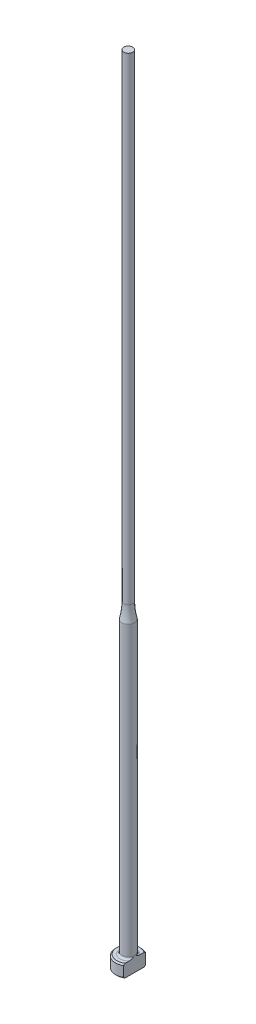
ISO-10303-21;
HEADER;
FILE_DESCRIPTION(('STEP AP214'),'2;1');
FILE_NAME('part.step','',(''),(''),'','','');
FILE_SCHEMA(('AUTOMOTIVE_DESIGN { 1 0 10303 214 1 1 1 1 }'));
ENDSEC;
DATA;
#1=APPLICATION_CONTEXT('core data for automotive mechanical design processes');
#2=APPLICATION_PROTOCOL_DEFINITION('international standard','automotive_design',2000,#1);
#3=PRODUCT_CONTEXT('',#1,'mechanical');
#4=PRODUCT('Part','Part','',(#3));
#5=PRODUCT_RELATED_PRODUCT_CATEGORY('part','',(#4));
#6=PRODUCT_DEFINITION_FORMATION('','',#4);
#7=PRODUCT_DEFINITION_CONTEXT('part definition',#1,'design');
#8=PRODUCT_DEFINITION('design','',#6,#7);
#9=PRODUCT_DEFINITION_SHAPE('','',#8);
#10=(LENGTH_UNIT() NAMED_UNIT(*) SI_UNIT(.MILLI.,.METRE.));
#11=(NAMED_UNIT(*) PLANE_ANGLE_UNIT() SI_UNIT($,.RADIAN.));
#12=(NAMED_UNIT(*) SI_UNIT($,.STERADIAN.) SOLID_ANGLE_UNIT());
#13=UNCERTAINTY_MEASURE_WITH_UNIT(LENGTH_MEASURE(1.E-05),#10,'distance_accuracy_value','');
#14=(GEOMETRIC_REPRESENTATION_CONTEXT(3) GLOBAL_UNCERTAINTY_ASSIGNED_CONTEXT((#13)) GLOBAL_UNIT_ASSIGNED_CONTEXT((#10,
#11,#12)) REPRESENTATION_CONTEXT('',''));
#15=CARTESIAN_POINT('',(0.,0.,0.));
#16=DIRECTION('',(0.,0.,1.));
#17=DIRECTION('',(1.,0.,0.));
#18=AXIS2_PLACEMENT_3D('',#15,#16,#17);
#19=CARTESIAN_POINT('',(-1.99999999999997,2.,0.));
#20=DIRECTION('',(0.,1.,0.));
#21=DIRECTION('',(0.,0.,1.));
#22=AXIS2_PLACEMENT_3D('',#19,#20,#21);
#23=PLANE('',#22);
#24=CARTESIAN_POINT('',(0.,2.,0.));
#25=DIRECTION('',(0.,1.,0.));
#26=DIRECTION('',(0.,0.,1.));
#27=AXIS2_PLACEMENT_3D('',#24,#25,#26);
#28=CIRCLE('',#27,1.79999999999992);
#29=CARTESIAN_POINT('',(0.999999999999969,2.,-1.4966629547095));
#30=VERTEX_POINT('',#29);
#31=CARTESIAN_POINT('',(0.999999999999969,2.,1.4966629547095));
#32=VERTEX_POINT('',#31);
#33=EDGE_CURVE('E187',#30,#32,#28,.T.);
#34=ORIENTED_EDGE('',*,*,#33,.T.);
#35=DIRECTION('',(0.,0.,-1.));
#36=VECTOR('',#35,1.);
#37=CARTESIAN_POINT('',(0.999999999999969,2.,0.));
#38=LINE('',#37,#36);
#39=CARTESIAN_POINT('',(0.999999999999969,2.00000000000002,0.830662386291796));
#40=VERTEX_POINT('',#39);
#41=EDGE_CURVE('E57',#32,#40,#38,.T.);
#42=ORIENTED_EDGE('',*,*,#41,.T.);
#43=CARTESIAN_POINT('',(0.,2.,0.));
#44=DIRECTION('',(0.,1.,0.));
#45=DIRECTION('',(0.,0.,1.));
#46=AXIS2_PLACEMENT_3D('',#43,#44,#45);
#47=CIRCLE('',#46,1.29999999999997);
#48=CARTESIAN_POINT('',(0.999999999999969,2.00000000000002,-0.830662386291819));
#49=VERTEX_POINT('',#48);
#50=EDGE_CURVE('E108',#40,#49,#47,.F.);
#51=ORIENTED_EDGE('',*,*,#50,.T.);
#52=EDGE_CURVE('E137',#49,#30,#38,.T.);
#53=ORIENTED_EDGE('',*,*,#52,.T.);
#54=EDGE_LOOP('',(#34,#42,#51,#53));
#55=FACE_BOUND('',#54,.T.);
#56=ADVANCED_FACE('F32',(#55),#23,.T.);
#57=CARTESIAN_POINT('',(0.,259.958771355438,0.));
#58=DIRECTION('',(0.,1.,0.));
#59=DIRECTION('',(0.,0.,1.));
#60=AXIS2_PLACEMENT_3D('',#57,#58,#59);
#61=CYLINDRICAL_SURFACE('',#60,1.99999999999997);
#62=CARTESIAN_POINT('',(0.,1.79999999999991,0.));
#63=DIRECTION('',(0.,1.,0.));
#64=DIRECTION('',(0.,0.,1.));
#65=AXIS2_PLACEMENT_3D('',#62,#63,#64);
#66=CIRCLE('',#65,1.99999999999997);
#67=CARTESIAN_POINT('',(0.999999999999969,1.79999999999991,1.73205080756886));
#68=VERTEX_POINT('',#67);
#69=CARTESIAN_POINT('',(0.999999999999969,1.79999999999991,-1.73205080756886));
#70=VERTEX_POINT('',#69);
#71=EDGE_CURVE('E105',#68,#70,#66,.F.);
#72=ORIENTED_EDGE('',*,*,#71,.T.);
#73=DIRECTION('',(0.,-1.,0.));
#74=VECTOR('',#73,1.);
#75=CARTESIAN_POINT('',(0.999999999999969,125.,-1.73205080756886));
#76=LINE('',#75,#74);
#77=CARTESIAN_POINT('',(0.999999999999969,0.199999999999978,-1.73205080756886));
#78=VERTEX_POINT('',#77);
#79=EDGE_CURVE('E193',#70,#78,#76,.T.);
#80=ORIENTED_EDGE('',*,*,#79,.T.);
#81=CARTESIAN_POINT('',(0.,0.199999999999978,0.));
#82=DIRECTION('',(0.,-1.,0.));
#83=DIRECTION('',(0.,0.,-1.));
#84=AXIS2_PLACEMENT_3D('',#81,#82,#83);
#85=CIRCLE('',#84,1.99999999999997);
#86=CARTESIAN_POINT('',(0.999999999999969,0.199999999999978,1.73205080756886));
#87=VERTEX_POINT('',#86);
#88=EDGE_CURVE('E100',#78,#87,#85,.F.);
#89=ORIENTED_EDGE('',*,*,#88,.T.);
#90=DIRECTION('',(0.,-1.,0.));
#91=VECTOR('',#90,1.);
#92=CARTESIAN_POINT('',(0.999999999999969,125.,1.73205080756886));
#93=LINE('',#92,#91);
#94=EDGE_CURVE('E93',#68,#87,#93,.T.);
#95=ORIENTED_EDGE('',*,*,#94,.F.);
#96=EDGE_LOOP('',(#72,#80,#89,#95));
#97=FACE_BOUND('',#96,.T.);
#98=ADVANCED_FACE('F158',(#97),#61,.T.);
#99=CARTESIAN_POINT('',(0.,0.,0.));
#100=DIRECTION('',(0.,-1.,0.));
#101=DIRECTION('',(0.,0.,-1.));
#102=AXIS2_PLACEMENT_3D('',#99,#100,#101);
#103=PLANE('',#102);
#104=CARTESIAN_POINT('',(0.,0.,0.));
#105=DIRECTION('',(0.,-1.,0.));
#106=DIRECTION('',(0.,0.,-1.));
#107=AXIS2_PLACEMENT_3D('',#104,#105,#106);
#108=CIRCLE('',#107,1.8);
#109=CARTESIAN_POINT('',(0.999999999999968,0.,1.49666295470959));
#110=VERTEX_POINT('',#109);
#111=CARTESIAN_POINT('',(0.999999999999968,0.,-1.49666295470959));
#112=VERTEX_POINT('',#111);
#113=EDGE_CURVE('E98',#110,#112,#108,.T.);
#114=ORIENTED_EDGE('',*,*,#113,.T.);
#115=DIRECTION('',(0.,0.,1.));
#116=VECTOR('',#115,1.);
#117=CARTESIAN_POINT('',(0.999999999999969,0.,-1.73205080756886));
#118=LINE('',#117,#116);
#119=EDGE_CURVE('E83',#112,#110,#118,.T.);
#120=ORIENTED_EDGE('',*,*,#119,.T.);
#121=EDGE_LOOP('',(#114,#120));
#122=FACE_BOUND('',#121,.T.);
#123=ADVANCED_FACE('F103',(#122),#103,.T.);
#124=CARTESIAN_POINT('',(0.,2.,0.));
#125=DIRECTION('',(0.,-1.,0.));
#126=DIRECTION('',(0.,0.,-1.));
#127=AXIS2_PLACEMENT_3D('',#124,#125,#126);
#128=CONICAL_SURFACE('',#127,1.79999999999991,0.785398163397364);
#129=ORIENTED_EDGE('',*,*,#71,.F.);
#130=CARTESIAN_POINT('',(0.999999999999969,-0.143084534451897,3.81417299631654));
#131=CARTESIAN_POINT('',(0.999999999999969,-0.0593997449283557,3.72765647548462));
#132=CARTESIAN_POINT('',(0.999999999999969,0.0241940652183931,3.64105173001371));
#133=CARTESIAN_POINT('',(0.999999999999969,0.19114891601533,3.46761616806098));
#134=CARTESIAN_POINT('',(0.999999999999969,0.27450995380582,3.38078534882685));
#135=CARTESIAN_POINT('',(0.999999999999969,0.52424932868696,3.11979400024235));
#136=CARTESIAN_POINT('',(0.999999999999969,0.690198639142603,2.94522254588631));
#137=CARTESIAN_POINT('',(0.999999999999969,1.0169755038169,2.59782670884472));
#138=CARTESIAN_POINT('',(0.999999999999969,1.1778392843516,2.42503661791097));
#139=CARTESIAN_POINT('',(0.999999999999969,1.41669118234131,2.16364984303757));
#140=CARTESIAN_POINT('',(0.999999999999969,1.49589273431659,2.07616357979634));
#141=CARTESIAN_POINT('',(0.999999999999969,1.653138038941,1.90015721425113));
#142=CARTESIAN_POINT('',(0.999999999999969,1.73118183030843,1.81163714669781));
#143=CARTESIAN_POINT('',(0.999999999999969,1.85567318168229,1.66767927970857));
#144=CARTESIAN_POINT('',(0.999999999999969,1.90265415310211,1.61270332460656));
#145=CARTESIAN_POINT('',(0.999999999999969,1.99577882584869,1.50203557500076));
#146=CARTESIAN_POINT('',(0.999999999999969,2.04192244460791,1.44634371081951));
#147=CARTESIAN_POINT('',(0.999999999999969,2.13356596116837,1.33345480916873));
#148=CARTESIAN_POINT('',(0.999999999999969,2.17905399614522,1.27624810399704));
#149=CARTESIAN_POINT('',(0.999999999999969,2.26844283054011,1.1606097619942));
#150=CARTESIAN_POINT('',(0.999999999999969,2.31234379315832,1.1021782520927));
#151=CARTESIAN_POINT('',(0.999999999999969,2.39853453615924,0.982773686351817));
#152=CARTESIAN_POINT('',(0.999999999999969,2.44078986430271,0.92177554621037));
#153=CARTESIAN_POINT('',(0.999999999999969,2.5218781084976,0.79738711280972));
#154=CARTESIAN_POINT('',(0.999999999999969,2.56070631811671,0.733993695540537));
#155=CARTESIAN_POINT('',(0.999999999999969,2.63248592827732,0.604932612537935));
#156=CARTESIAN_POINT('',(0.999999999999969,2.66550424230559,0.539302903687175));
#157=CARTESIAN_POINT('',(0.999999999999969,2.72301550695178,0.404437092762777));
#158=CARTESIAN_POINT('',(0.999999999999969,2.74753707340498,0.335214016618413));
#159=CARTESIAN_POINT('',(0.999999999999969,2.77407110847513,0.231400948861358));
#160=CARTESIAN_POINT('',(0.999999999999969,2.78110742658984,0.198093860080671));
#161=CARTESIAN_POINT('',(0.999999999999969,2.79200506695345,0.130954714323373));
#162=CARTESIAN_POINT('',(0.999999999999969,2.79586666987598,0.0971227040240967));
#163=CARTESIAN_POINT('',(0.999999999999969,2.80013905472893,0.0293410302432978));
#164=CARTESIAN_POINT('',(0.999999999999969,2.80056046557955,-0.00460794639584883));
#165=CARTESIAN_POINT('',(0.999999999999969,2.79795882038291,-0.0723663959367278));
#166=CARTESIAN_POINT('',(0.999999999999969,2.79493547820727,-0.106175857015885));
#167=CARTESIAN_POINT('',(0.999999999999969,2.78105481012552,-0.206326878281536));
#168=CARTESIAN_POINT('',(0.999999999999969,2.76542146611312,-0.272037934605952));
#169=CARTESIAN_POINT('',(0.999999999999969,2.73477554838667,-0.368312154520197));
#170=CARTESIAN_POINT('',(0.999999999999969,2.72331063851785,-0.400123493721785));
#171=CARTESIAN_POINT('',(0.999999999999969,2.69840546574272,-0.462964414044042));
#172=CARTESIAN_POINT('',(0.999999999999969,2.68496560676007,-0.493994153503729));
#173=CARTESIAN_POINT('',(0.999999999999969,2.64209309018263,-0.586298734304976));
#174=CARTESIAN_POINT('',(0.999999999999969,2.61022871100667,-0.64643570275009));
#175=CARTESIAN_POINT('',(0.999999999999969,2.54228534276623,-0.76430433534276));
#176=CARTESIAN_POINT('',(0.999999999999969,2.50620119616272,-0.822032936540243));
#177=CARTESIAN_POINT('',(0.999999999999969,2.43107084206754,-0.935840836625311));
#178=CARTESIAN_POINT('',(0.999999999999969,2.39201347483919,-0.991912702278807));
#179=CARTESIAN_POINT('',(0.999999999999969,2.31195870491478,-1.10259849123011));
#180=CARTESIAN_POINT('',(0.999999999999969,2.27096226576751,-1.15721311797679));
#181=CARTESIAN_POINT('',(0.999999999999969,2.18701695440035,-1.26606869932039));
#182=CARTESIAN_POINT('',(0.999999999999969,2.14404946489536,-1.32029522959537));
#183=CARTESIAN_POINT('',(0.999999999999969,2.05705050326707,-1.42788988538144));
#184=CARTESIAN_POINT('',(0.999999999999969,2.01301896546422,-1.48125795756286));
#185=CARTESIAN_POINT('',(0.999999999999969,1.8799506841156,-1.64010952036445));
#186=CARTESIAN_POINT('',(0.999999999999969,1.78973357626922,-1.74460261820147));
#187=CARTESIAN_POINT('',(0.999999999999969,1.62290341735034,-1.9342683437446));
#188=CARTESIAN_POINT('',(0.999999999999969,1.54658658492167,-2.01970404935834));
#189=CARTESIAN_POINT('',(0.999999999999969,1.39301250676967,-2.18973019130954));
#190=CARTESIAN_POINT('',(0.999999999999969,1.31575523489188,-2.27432060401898));
#191=CARTESIAN_POINT('',(0.999999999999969,1.08283440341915,-2.52732479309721));
#192=CARTESIAN_POINT('',(0.999999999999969,0.926165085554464,-2.69481086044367));
#193=CARTESIAN_POINT('',(0.999999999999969,0.617772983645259,-3.0214725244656));
#194=CARTESIAN_POINT('',(0.999999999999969,0.466111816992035,-3.18070657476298));
#195=CARTESIAN_POINT('',(0.999999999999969,0.238015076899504,-3.41880818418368));
#196=CARTESIAN_POINT('',(0.999999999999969,0.161924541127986,-3.49800657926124));
#197=CARTESIAN_POINT('',(0.999999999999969,0.00955322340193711,-3.65621892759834));
#198=CARTESIAN_POINT('',(0.999999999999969,-0.0667275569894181,-3.73523288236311));
#199=CARTESIAN_POINT('',(0.999999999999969,-0.143084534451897,-3.81417299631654));
#200=B_SPLINE_CURVE_WITH_KNOTS('',3,(#130,#131,#132,#133,#134,#135,#136,#137,#138,#139,#140,
#141,#142,#143,#144,#145,#146,#147,#148,#149,#150,#151,#152,#153,#154,#155,#156,#157,#158,#159,
#160,#161,#162,#163,#164,#165,#166,#167,#168,#169,#170,#171,#172,#173,#174,#175,#176,#177,#178,
#179,#180,#181,#182,#183,#184,#185,#186,#187,#188,#189,#190,#191,#192,#193,#194,#195,#196,#197,
#198,#199),.UNSPECIFIED.,.F.,.F.,(4,2,2,2,2,2,2,2,2,2,2,2,2,2,2,2,2,2,2,2,2,2,2,2,2,2,2,2,2,2,2,
2,2,2,4),(0.,0.361101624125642,0.722207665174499,1.44478731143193,2.15299784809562,
2.50702638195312,2.86104304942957,3.07798416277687,3.29494655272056,3.51418925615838,
3.73340935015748,3.95594813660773,4.17878792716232,4.3988639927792,4.6181915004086,
4.72018864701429,4.82217677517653,4.92384967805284,5.02553102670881,5.22698459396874,
5.32838854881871,5.4297717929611,5.63365200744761,5.83778406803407,6.04272417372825,
6.24756349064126,6.4551039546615,6.66265726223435,7.07676259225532,7.42043039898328,
7.76410778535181,8.45210822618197,9.11180822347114,9.44129145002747,9.77077197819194),.UNSPECIFIED.);
#201=EDGE_CURVE('E136',#68,#32,#200,.T.);
#202=ORIENTED_EDGE('',*,*,#201,.T.);
#203=ORIENTED_EDGE('',*,*,#33,.F.);
#204=EDGE_CURVE('E128',#30,#70,#200,.T.);
#205=ORIENTED_EDGE('',*,*,#204,.T.);
#206=EDGE_LOOP('',(#129,#202,#203,#205));
#207=FACE_BOUND('',#206,.T.);
#208=ADVANCED_FACE('F144',(#207),#128,.T.);
#209=CARTESIAN_POINT('',(0.,0.199999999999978,0.));
#210=DIRECTION('',(0.,1.,0.));
#211=DIRECTION('',(0.,0.,1.));
#212=AXIS2_PLACEMENT_3D('',#209,#210,#211);
#213=CONICAL_SURFACE('',#212,1.99999999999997,0.785398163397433);
#214=ORIENTED_EDGE('',*,*,#88,.F.);
#215=CARTESIAN_POINT('',(0.999999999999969,2.14308453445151,-3.81417299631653));
#216=CARTESIAN_POINT('',(0.999999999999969,2.05939974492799,-3.72765647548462));
#217=CARTESIAN_POINT('',(0.999999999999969,1.97580593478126,-3.64105173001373));
#218=CARTESIAN_POINT('',(0.999999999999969,1.80885108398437,-3.46761616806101));
#219=CARTESIAN_POINT('',(0.999999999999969,1.7254900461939,-3.38078534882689));
#220=CARTESIAN_POINT('',(0.999999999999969,1.47575067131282,-3.11979400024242));
#221=CARTESIAN_POINT('',(0.999999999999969,1.30980136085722,-2.94522254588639));
#222=CARTESIAN_POINT('',(0.999999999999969,0.983024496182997,-2.59782670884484));
#223=CARTESIAN_POINT('',(0.999999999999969,0.822160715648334,-2.42503661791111));
#224=CARTESIAN_POINT('',(0.999999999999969,0.583308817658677,-2.16364984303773));
#225=CARTESIAN_POINT('',(0.999999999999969,0.504107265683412,-2.07616357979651));
#226=CARTESIAN_POINT('',(0.999999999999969,0.34686196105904,-1.90015721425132));
#227=CARTESIAN_POINT('',(0.999999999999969,0.268818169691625,-1.81163714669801));
#228=CARTESIAN_POINT('',(0.999999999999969,0.144326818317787,-1.66767927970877));
#229=CARTESIAN_POINT('',(0.999999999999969,0.097345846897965,-1.61270332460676));
#230=CARTESIAN_POINT('',(0.999999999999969,0.00422117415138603,-1.50203557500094));
#231=CARTESIAN_POINT('',(0.999999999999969,-0.0419224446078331,-1.44634371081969));
#232=CARTESIAN_POINT('',(0.999999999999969,-0.133565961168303,-1.33345480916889));
#233=CARTESIAN_POINT('',(0.999999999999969,-0.179053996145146,-1.2762481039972));
#234=CARTESIAN_POINT('',(0.999999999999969,-0.268442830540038,-1.16060976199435));
#235=CARTESIAN_POINT('',(0.999999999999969,-0.312343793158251,-1.10217825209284));
#236=CARTESIAN_POINT('',(0.999999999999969,-0.398534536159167,-0.982773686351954));
#237=CARTESIAN_POINT('',(0.999999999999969,-0.440789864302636,-0.921775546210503));
#238=CARTESIAN_POINT('',(0.999999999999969,-0.521878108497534,-0.797387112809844));
#239=CARTESIAN_POINT('',(0.999999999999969,-0.560706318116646,-0.733993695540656));
#240=CARTESIAN_POINT('',(0.999999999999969,-0.632485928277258,-0.604932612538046));
#241=CARTESIAN_POINT('',(0.999999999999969,-0.665504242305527,-0.539302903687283));
#242=CARTESIAN_POINT('',(0.999999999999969,-0.723015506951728,-0.404437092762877));
#243=CARTESIAN_POINT('',(0.999999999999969,-0.747537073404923,-0.335214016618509));
#244=CARTESIAN_POINT('',(0.999999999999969,-0.774071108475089,-0.231400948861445));
#245=CARTESIAN_POINT('',(0.999999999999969,-0.781107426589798,-0.198093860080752));
#246=CARTESIAN_POINT('',(0.999999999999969,-0.792005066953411,-0.130954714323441));
#247=CARTESIAN_POINT('',(0.999999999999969,-0.795866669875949,-0.097122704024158));
#248=CARTESIAN_POINT('',(0.999999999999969,-0.800139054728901,-0.0293410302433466));
#249=CARTESIAN_POINT('',(0.999999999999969,-0.800560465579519,0.00460794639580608));
#250=CARTESIAN_POINT('',(0.999999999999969,-0.797958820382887,0.0723663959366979));
#251=CARTESIAN_POINT('',(0.999999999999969,-0.794935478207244,0.106175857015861));
#252=CARTESIAN_POINT('',(0.999999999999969,-0.78105481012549,0.206326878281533));
#253=CARTESIAN_POINT('',(0.999999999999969,-0.765421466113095,0.272037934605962));
#254=CARTESIAN_POINT('',(0.999999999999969,-0.734775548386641,0.368312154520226));
#255=CARTESIAN_POINT('',(0.999999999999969,-0.723310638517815,0.40012349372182));
#256=CARTESIAN_POINT('',(0.999999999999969,-0.698405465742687,0.46296441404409));
#257=CARTESIAN_POINT('',(0.999999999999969,-0.684965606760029,0.493994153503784));
#258=CARTESIAN_POINT('',(0.999999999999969,-0.642093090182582,0.586298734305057));
#259=CARTESIAN_POINT('',(0.999999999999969,-0.610228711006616,0.64643570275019));
#260=CARTESIAN_POINT('',(0.999999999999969,-0.542285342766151,0.764304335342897));
#261=CARTESIAN_POINT('',(0.999999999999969,-0.506201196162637,0.822032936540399));
#262=CARTESIAN_POINT('',(0.999999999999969,-0.431070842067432,0.935840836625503));
#263=CARTESIAN_POINT('',(0.999999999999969,-0.392013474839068,0.991912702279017));
#264=CARTESIAN_POINT('',(0.999999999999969,-0.311958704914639,1.10259849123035));
#265=CARTESIAN_POINT('',(0.999999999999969,-0.27096226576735,1.15721311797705));
#266=CARTESIAN_POINT('',(0.999999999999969,-0.187016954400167,1.26606869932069));
#267=CARTESIAN_POINT('',(0.999999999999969,-0.144049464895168,1.32029522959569));
#268=CARTESIAN_POINT('',(0.999999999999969,-0.0570505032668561,1.4278898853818));
#269=CARTESIAN_POINT('',(0.999999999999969,-0.0130189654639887,1.48125795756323));
#270=CARTESIAN_POINT('',(0.999999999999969,0.120049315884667,1.64010952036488));
#271=CARTESIAN_POINT('',(0.999999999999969,0.21026642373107,1.74460261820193));
#272=CARTESIAN_POINT('',(0.999999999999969,0.377096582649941,1.93426834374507));
#273=CARTESIAN_POINT('',(0.999999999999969,0.453413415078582,2.01970404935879));
#274=CARTESIAN_POINT('',(0.999999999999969,0.606987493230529,2.18973019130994));
#275=CARTESIAN_POINT('',(0.999999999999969,0.684244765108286,2.27432060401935));
#276=CARTESIAN_POINT('',(0.999999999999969,0.917165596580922,2.52732479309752));
#277=CARTESIAN_POINT('',(0.999999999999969,1.07383491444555,2.69481086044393));
#278=CARTESIAN_POINT('',(0.999999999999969,1.38222701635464,3.02147252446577));
#279=CARTESIAN_POINT('',(0.999999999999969,1.53388818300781,3.18070657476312));
#280=CARTESIAN_POINT('',(0.999999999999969,1.76198492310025,3.41880818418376));
#281=CARTESIAN_POINT('',(0.999999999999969,1.83807545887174,3.49800657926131));
#282=CARTESIAN_POINT('',(0.999999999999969,1.99044677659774,3.65621892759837));
#283=CARTESIAN_POINT('',(0.999999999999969,2.06672755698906,3.73523288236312));
#284=CARTESIAN_POINT('',(0.999999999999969,2.14308453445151,3.81417299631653));
#285=B_SPLINE_CURVE_WITH_KNOTS('',3,(#215,#216,#217,#218,#219,#220,#221,#222,#223,#224,#225,
#226,#227,#228,#229,#230,#231,#232,#233,#234,#235,#236,#237,#238,#239,#240,#241,#242,#243,#244,
#245,#246,#247,#248,#249,#250,#251,#252,#253,#254,#255,#256,#257,#258,#259,#260,#261,#262,#263,
#264,#265,#266,#267,#268,#269,#270,#271,#272,#273,#274,#275,#276,#277,#278,#279,#280,#281,#282,
#283,#284),.UNSPECIFIED.,.F.,.F.,(4,2,2,2,2,2,2,2,2,2,2,2,2,2,2,2,2,2,2,2,2,2,2,2,2,2,2,2,2,2,2,
2,2,2,4),(0.,0.36110162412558,0.722207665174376,1.44478731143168,2.15299784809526,
2.5070263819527,2.8610430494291,3.07798416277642,3.29494655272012,3.51418925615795,
3.73340935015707,3.95594813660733,4.17878792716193,4.39886399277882,4.61819150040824,
4.72018864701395,4.82217677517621,4.92384967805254,5.02553102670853,5.22698459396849,
5.32838854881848,5.42977179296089,5.63365200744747,5.83778406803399,6.04272417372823,
6.24756349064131,6.45510395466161,6.66265726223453,7.07676259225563,7.42043039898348,
7.7641077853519,8.45210822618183,9.1118082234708,9.44129145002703,9.77077197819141),.UNSPECIFIED.);
#286=EDGE_CURVE('E86',#78,#112,#285,.T.);
#287=ORIENTED_EDGE('',*,*,#286,.T.);
#288=ORIENTED_EDGE('',*,*,#113,.F.);
#289=EDGE_CURVE('E89',#110,#87,#285,.T.);
#290=ORIENTED_EDGE('',*,*,#289,.T.);
#291=EDGE_LOOP('',(#214,#287,#288,#290));
#292=FACE_BOUND('',#291,.T.);
#293=ADVANCED_FACE('F97',(#292),#213,.T.);
#294=CARTESIAN_POINT('',(0.,2.30000000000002,0.));
#295=DIRECTION('',(0.,1.,0.));
#296=DIRECTION('',(0.,0.,1.));
#297=AXIS2_PLACEMENT_3D('',#294,#295,#296);
#298=TOROIDAL_SURFACE('',#297,1.29999999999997,0.3);
#299=CARTESIAN_POINT('',(0.999999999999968,2.30000000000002,0.));
#300=CARTESIAN_POINT('',(0.999999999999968,2.30000064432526,8.6574445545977E-12));
#301=CARTESIAN_POINT('',(0.999999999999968,2.30000128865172,-9.05742231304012E-08));
#302=CARTESIAN_POINT('',(0.999999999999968,2.30000254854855,-3.98319620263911E-07));
#303=CARTESIAN_POINT('',(0.999999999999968,2.30000316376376,-6.16748313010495E-07));
#304=CARTESIAN_POINT('',(0.999999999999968,2.30000438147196,-1.15047367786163E-06));
#305=CARTESIAN_POINT('',(0.999999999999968,2.30000498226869,-1.46954564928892E-06));
#306=CARTESIAN_POINT('',(0.999999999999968,2.30000613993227,-2.17388585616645E-06));
#307=CARTESIAN_POINT('',(0.999999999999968,2.3000066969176,-2.55896592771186E-06));
#308=CARTESIAN_POINT('',(0.999999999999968,2.30000847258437,-3.89137454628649E-06));
#309=CARTESIAN_POINT('',(0.999999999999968,2.30000962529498,-4.9272569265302E-06));
#310=CARTESIAN_POINT('',(0.999999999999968,2.30001175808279,-7.12255376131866E-06));
#311=CARTESIAN_POINT('',(0.999999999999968,2.30001274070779,-8.27963246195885E-06));
#312=CARTESIAN_POINT('',(0.999999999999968,2.30001619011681,-1.25710396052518E-05));
#313=CARTESIAN_POINT('',(0.999999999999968,2.30001847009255,-1.58589994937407E-05));
#314=CARTESIAN_POINT('',(0.999999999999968,2.3000224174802,-2.25210462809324E-05));
#315=CARTESIAN_POINT('',(0.999999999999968,2.30002411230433,-2.58796667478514E-05));
#316=CARTESIAN_POINT('',(0.999999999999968,2.30003085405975,-3.94941957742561E-05));
#317=CARTESIAN_POINT('',(0.999999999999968,2.30003568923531,-4.98493079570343E-05));
#318=CARTESIAN_POINT('',(0.999999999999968,2.30004388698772,-6.96407730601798E-05));
#319=CARTESIAN_POINT('',(0.999999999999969,2.30004735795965,-7.903098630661E-05));
#320=CARTESIAN_POINT('',(0.999999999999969,2.30007348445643,-0.000144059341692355));
#321=CARTESIAN_POINT('',(0.999999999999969,2.30010510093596,-0.000195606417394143));
#322=CARTESIAN_POINT('',(0.999999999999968,2.30022061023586,-0.000391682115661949));
#323=CARTESIAN_POINT('',(0.999999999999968,2.3002978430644,-0.000539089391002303));
#324=CARTESIAN_POINT('',(0.999999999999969,2.30059433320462,-0.00109591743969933));
#325=CARTESIAN_POINT('',(0.999999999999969,2.30082052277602,-0.00150237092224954));
#326=CARTESIAN_POINT('',(0.999999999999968,2.30171558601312,-0.00311941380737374));
#327=CARTESIAN_POINT('',(0.999999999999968,2.30237677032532,-0.00433326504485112));
#328=CARTESIAN_POINT('',(0.999999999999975,2.31602135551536,-0.0293725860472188));
#329=CARTESIAN_POINT('',(0.99999999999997,2.32909104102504,-0.0531623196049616));
#330=CARTESIAN_POINT('',(0.999999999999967,2.35458080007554,-0.100088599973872));
#331=CARTESIAN_POINT('',(0.999999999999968,2.36700820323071,-0.123221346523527));
#332=CARTESIAN_POINT('',(0.999999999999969,2.39281545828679,-0.172044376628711));
#333=CARTESIAN_POINT('',(0.999999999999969,2.4061616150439,-0.197752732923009));
#334=CARTESIAN_POINT('',(0.999999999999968,2.4323541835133,-0.249714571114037));
#335=CARTESIAN_POINT('',(0.999999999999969,2.44519503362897,-0.27597087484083));
#336=CARTESIAN_POINT('',(0.999999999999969,2.46718175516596,-0.322864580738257));
#337=CARTESIAN_POINT('',(0.999999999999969,2.47650292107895,-0.34341923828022));
#338=CARTESIAN_POINT('',(0.999999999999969,2.49448113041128,-0.384761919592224));
#339=CARTESIAN_POINT('',(0.999999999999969,2.50313958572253,-0.405549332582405));
#340=CARTESIAN_POINT('',(0.999999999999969,2.5276434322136,-0.467585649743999));
#341=CARTESIAN_POINT('',(0.999999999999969,2.54239224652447,-0.509286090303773));
#342=CARTESIAN_POINT('',(0.999999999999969,2.56458900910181,-0.58349816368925));
#343=CARTESIAN_POINT('',(0.999999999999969,2.57294045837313,-0.61573699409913));
#344=CARTESIAN_POINT('',(0.999999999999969,2.58691787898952,-0.682155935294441));
#345=CARTESIAN_POINT('',(0.999999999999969,2.5924232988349,-0.716362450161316));
#346=CARTESIAN_POINT('',(0.999999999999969,2.59932200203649,-0.784996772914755));
#347=CARTESIAN_POINT('',(0.999999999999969,2.60074119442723,-0.819421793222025));
#348=CARTESIAN_POINT('',(0.999999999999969,2.59853032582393,-0.88779225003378));
#349=CARTESIAN_POINT('',(0.999999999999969,2.59495737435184,-0.921738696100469));
#350=CARTESIAN_POINT('',(0.999999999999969,2.58381038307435,-0.977927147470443));
#351=CARTESIAN_POINT('',(0.999999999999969,2.57785171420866,-1.00048693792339));
#352=CARTESIAN_POINT('',(0.999999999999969,2.56267132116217,-1.0445512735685));
#353=CARTESIAN_POINT('',(0.999999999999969,2.55344592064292,-1.06605459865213));
#354=CARTESIAN_POINT('',(0.999999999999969,2.53348156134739,-1.10327564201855));
#355=CARTESIAN_POINT('',(0.999999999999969,2.52335553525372,-1.11931996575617));
#356=CARTESIAN_POINT('',(0.999999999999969,2.50063930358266,-1.1495565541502));
#357=CARTESIAN_POINT('',(0.999999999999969,2.48805327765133,-1.16375189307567));
#358=CARTESIAN_POINT('',(0.999999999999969,2.46313284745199,-1.18709127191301));
#359=CARTESIAN_POINT('',(0.999999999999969,2.45121755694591,-1.19668155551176));
#360=CARTESIAN_POINT('',(0.999999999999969,2.4259612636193,-1.21377371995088));
#361=CARTESIAN_POINT('',(0.999999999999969,2.41262072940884,-1.2212762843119));
#362=CARTESIAN_POINT('',(0.999999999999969,2.38471163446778,-1.23381879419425));
#363=CARTESIAN_POINT('',(0.999999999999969,2.3701356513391,-1.23884240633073));
#364=CARTESIAN_POINT('',(0.999999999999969,2.34029120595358,-1.2460136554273));
#365=CARTESIAN_POINT('',(0.999999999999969,2.32502317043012,-1.24816304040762));
#366=CARTESIAN_POINT('',(0.999999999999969,2.29609418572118,-1.24936303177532));
#367=CARTESIAN_POINT('',(0.999999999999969,2.28244572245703,-1.24873511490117));
#368=CARTESIAN_POINT('',(0.999999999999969,2.25546467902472,-1.24513625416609));
#369=CARTESIAN_POINT('',(0.999999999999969,2.2421320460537,-1.24216570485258));
#370=CARTESIAN_POINT('',(0.999999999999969,2.21644742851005,-1.23414136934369));
#371=CARTESIAN_POINT('',(0.999999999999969,2.20408009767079,-1.22913614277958));
#372=CARTESIAN_POINT('',(0.999999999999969,2.18026539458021,-1.2172891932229));
#373=CARTESIAN_POINT('',(0.999999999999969,2.16881815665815,-1.21044720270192));
#374=CARTESIAN_POINT('',(0.999999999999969,2.14602713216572,-1.19450929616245));
#375=CARTESIAN_POINT('',(0.999999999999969,2.1347876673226,-1.18526487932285));
#376=CARTESIAN_POINT('',(0.999999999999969,2.11372805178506,-1.16528066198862));
#377=CARTESIAN_POINT('',(0.999999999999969,2.1039092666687,-1.15453944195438));
#378=CARTESIAN_POINT('',(0.999999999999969,2.08131380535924,-1.12639326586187));
#379=CARTESIAN_POINT('',(0.999999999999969,2.06941227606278,-1.10828305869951));
#380=CARTESIAN_POINT('',(0.999999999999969,2.04871157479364,-1.07041295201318));
#381=CARTESIAN_POINT('',(0.999999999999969,2.03991325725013,-1.05065259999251));
#382=CARTESIAN_POINT('',(0.999999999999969,2.02219264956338,-1.00203188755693));
#383=CARTESIAN_POINT('',(0.999999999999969,2.01461756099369,-0.972682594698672));
#384=CARTESIAN_POINT('',(0.999999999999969,2.00410660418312,-0.912914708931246));
#385=CARTESIAN_POINT('',(0.999999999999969,2.00122174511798,-0.882487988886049));
#386=CARTESIAN_POINT('',(0.999999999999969,1.99886242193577,-0.80318909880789));
#387=CARTESIAN_POINT('',(0.999999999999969,2.0024814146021,-0.754226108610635));
#388=CARTESIAN_POINT('',(0.999999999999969,2.01327071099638,-0.682724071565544));
#389=CARTESIAN_POINT('',(0.999999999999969,2.01762186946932,-0.659663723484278));
#390=CARTESIAN_POINT('',(0.999999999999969,2.02775671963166,-0.613959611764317));
#391=CARTESIAN_POINT('',(0.999999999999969,2.03353398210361,-0.59131445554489));
#392=CARTESIAN_POINT('',(0.999999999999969,2.05232003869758,-0.525222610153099));
#393=CARTESIAN_POINT('',(0.999999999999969,2.0670175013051,-0.482256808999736));
#394=CARTESIAN_POINT('',(0.999999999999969,2.09166172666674,-0.418361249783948));
#395=CARTESIAN_POINT('',(0.999999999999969,2.10040936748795,-0.396945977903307));
#396=CARTESIAN_POINT('',(0.999999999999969,2.11862724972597,-0.354367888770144));
#397=CARTESIAN_POINT('',(0.999999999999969,2.12809902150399,-0.33320572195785));
#398=CARTESIAN_POINT('',(0.999999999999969,2.15054796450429,-0.284809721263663));
#399=CARTESIAN_POINT('',(0.999999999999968,2.16372144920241,-0.257667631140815));
#400=CARTESIAN_POINT('',(0.999999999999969,2.19063957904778,-0.203972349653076));
#401=CARTESIAN_POINT('',(0.999999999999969,2.20437810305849,-0.177416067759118));
#402=CARTESIAN_POINT('',(0.999999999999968,2.23096755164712,-0.127000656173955));
#403=CARTESIAN_POINT('',(0.999999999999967,2.2437812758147,-0.103121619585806));
#404=CARTESIAN_POINT('',(0.99999999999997,2.27007504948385,-0.0546869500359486));
#405=CARTESIAN_POINT('',(0.999999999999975,2.28356304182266,-0.0301354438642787));
#406=CARTESIAN_POINT('',(0.999999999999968,2.29762327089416,-0.00433318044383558));
#407=CARTESIAN_POINT('',(0.999999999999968,2.29828450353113,-0.00311924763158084));
#408=CARTESIAN_POINT('',(0.999999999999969,2.29917957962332,-0.0015021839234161));
#409=CARTESIAN_POINT('',(0.999999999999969,2.2994057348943,-0.0010957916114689));
#410=CARTESIAN_POINT('',(0.999999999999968,2.29970218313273,-0.000539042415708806));
#411=CARTESIAN_POINT('',(0.999999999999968,2.29977940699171,-0.000391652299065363));
#412=CARTESIAN_POINT('',(0.999999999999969,2.29989490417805,-0.000195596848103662));
#413=CARTESIAN_POINT('',(0.999999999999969,2.2999265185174,-0.000144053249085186));
#414=CARTESIAN_POINT('',(0.999999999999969,2.29995264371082,-7.90290824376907E-05));
#415=CARTESIAN_POINT('',(0.999999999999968,2.29995611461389,-6.96391975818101E-05));
#416=CARTESIAN_POINT('',(0.999999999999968,2.29996431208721,-4.98484228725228E-05));
#417=CARTESIAN_POINT('',(0.999999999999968,2.29996914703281,-3.94936645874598E-05));
#418=CARTESIAN_POINT('',(0.999999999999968,2.29997588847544,-2.587953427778E-05));
#419=CARTESIAN_POINT('',(0.999999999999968,2.29997758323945,-2.25209724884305E-05));
#420=CARTESIAN_POINT('',(0.999999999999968,2.29998153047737,-1.58590310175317E-05));
#421=CARTESIAN_POINT('',(0.999999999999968,2.29998381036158,-1.25711163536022E-05));
#422=CARTESIAN_POINT('',(0.999999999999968,2.29998725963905,-8.27974911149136E-06));
#423=CARTESIAN_POINT('',(0.999999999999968,2.29998824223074,-7.122675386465E-06));
#424=CARTESIAN_POINT('',(0.999999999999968,2.29999037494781,-4.92738159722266E-06));
#425=CARTESIAN_POINT('',(0.999999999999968,2.29999152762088,-3.89149712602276E-06));
#426=CARTESIAN_POINT('',(0.999999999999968,2.29999330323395,-2.5590774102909E-06));
#427=CARTESIAN_POINT('',(0.999999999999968,2.29999386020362,-2.17399250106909E-06));
#428=CARTESIAN_POINT('',(0.999999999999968,2.29999501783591,-1.4696398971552E-06));
#429=CARTESIAN_POINT('',(0.999999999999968,2.299995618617,-1.15056035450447E-06));
#430=CARTESIAN_POINT('',(0.999999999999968,2.29999683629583,-6.16816558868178E-07));
#431=CARTESIAN_POINT('',(0.999999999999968,2.29999745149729,-3.98377208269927E-07));
#432=CARTESIAN_POINT('',(0.999999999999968,2.29999871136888,-9.06063088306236E-08));
#433=CARTESIAN_POINT('',(0.999999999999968,2.29999935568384,-8.657323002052E-12));
#434=CARTESIAN_POINT('',(0.999999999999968,2.30000000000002,0.));
#435=B_SPLINE_CURVE_WITH_KNOTS('',3,(#299,#300,#301,#302,#303,#304,#305,#306,#307,#308,#309,
#310,#311,#312,#313,#314,#315,#316,#317,#318,#319,#320,#321,#322,#323,#324,#325,#326,#327,#328,
#329,#330,#331,#332,#333,#334,#335,#336,#337,#338,#339,#340,#341,#342,#343,#344,#345,#346,#347,
#348,#349,#350,#351,#352,#353,#354,#355,#356,#357,#358,#359,#360,#361,#362,#363,#364,#365,#366,
#367,#368,#369,#370,#371,#372,#373,#374,#375,#376,#377,#378,#379,#380,#381,#382,#383,#384,#385,
#386,#387,#388,#389,#390,#391,#392,#393,#394,#395,#396,#397,#398,#399,#400,#401,#402,#403,#404,
#405,#406,#407,#408,#409,#410,#411,#412,#413,#414,#415,#416,#417,#418,#419,#420,#421,#422,#423,
#424,#425,#426,#427,#428,#429,#430,#431,#432,#433,#434),.UNSPECIFIED.,.T.,.F.,(4,2,2,2,2,2,2,2,
2,2,2,2,2,2,2,2,2,2,2,2,2,2,2,2,2,2,2,2,2,2,2,2,2,2,2,2,2,2,2,2,2,2,2,2,2,2,2,2,2,2,2,2,2,2,2,2,
2,2,2,2,2,2,2,2,2,2,2,4),(0.,1.93088000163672E-06,3.88121487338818E-06,5.91576027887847E-06,
7.94459959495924E-06,1.25713540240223E-05,1.71213138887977E-05,2.9075120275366E-05,
4.0350817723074E-05,7.46190414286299E-05,0.000104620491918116,0.00028499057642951,
0.000785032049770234,0.00217951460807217,0.00632720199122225,0.0877445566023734,
0.166524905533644,0.253417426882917,0.341089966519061,0.408787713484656,0.476336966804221,
0.608850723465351,0.708652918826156,0.812393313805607,0.915474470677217,1.01738599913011,
1.08718721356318,1.15706723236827,1.21377727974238,1.27039179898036,1.31609373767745,
1.36178069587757,1.40776478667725,1.4537208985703,1.49450576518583,1.5352837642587,
1.57514089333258,1.61500383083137,1.65849635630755,1.70203041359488,1.76667915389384,
1.83134568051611,1.92177629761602,2.0131839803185,2.15955153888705,2.22993031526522,
2.29999742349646,2.43600819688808,2.50540041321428,2.57494356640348,2.66544006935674,
2.75513178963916,2.83643278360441,2.92045687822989,2.92460484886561,2.92599912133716,
2.926499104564,2.92667946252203,2.92670946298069,2.92674372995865,2.92675500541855,
2.92676695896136,2.92677150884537,2.92677613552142,2.92677816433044,2.92678019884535,
2.92678214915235,2.92678408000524),.UNSPECIFIED.);
#436=CARTESIAN_POINT('',(0.999999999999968,2.30000000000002,0.));
#437=VERTEX_POINT('',#436);
#438=EDGE_CURVE('E11',#49,#437,#435,.T.);
#439=ORIENTED_EDGE('',*,*,#438,.F.);
#440=ORIENTED_EDGE('',*,*,#50,.F.);
#441=CARTESIAN_POINT('',(0.999999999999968,2.30000000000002,0.));
#442=CARTESIAN_POINT('',(0.999999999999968,2.29999935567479,-8.65741696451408E-12));
#443=CARTESIAN_POINT('',(0.999999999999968,2.29999871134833,9.05742231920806E-08));
#444=CARTESIAN_POINT('',(0.999999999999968,2.2999974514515,3.98319620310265E-07));
#445=CARTESIAN_POINT('',(0.999999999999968,2.29999683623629,6.16748313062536E-07));
#446=CARTESIAN_POINT('',(0.999999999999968,2.29999561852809,1.15047367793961E-06));
#447=CARTESIAN_POINT('',(0.999999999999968,2.29999501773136,1.46954564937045E-06));
#448=CARTESIAN_POINT('',(0.999999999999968,2.29999386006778,2.17388585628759E-06));
#449=CARTESIAN_POINT('',(0.999999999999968,2.29999330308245,2.55896592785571E-06));
#450=CARTESIAN_POINT('',(0.999999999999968,2.29999152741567,3.89137454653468E-06));
#451=CARTESIAN_POINT('',(0.999999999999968,2.29999037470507,4.92725692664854E-06));
#452=CARTESIAN_POINT('',(0.999999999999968,2.29998824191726,7.12255376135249E-06));
#453=CARTESIAN_POINT('',(0.999999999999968,2.29998725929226,8.27963246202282E-06));
#454=CARTESIAN_POINT('',(0.999999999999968,2.29998380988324,1.25710396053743E-05));
#455=CARTESIAN_POINT('',(0.999999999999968,2.2999815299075,1.58589994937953E-05));
#456=CARTESIAN_POINT('',(0.999999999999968,2.29997758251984,2.25210462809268E-05));
#457=CARTESIAN_POINT('',(0.999999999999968,2.29997588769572,2.58796667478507E-05));
#458=CARTESIAN_POINT('',(0.999999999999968,2.29996914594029,3.94941957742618E-05));
#459=CARTESIAN_POINT('',(0.999999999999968,2.29996431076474,4.98493079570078E-05));
#460=CARTESIAN_POINT('',(0.999999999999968,2.29995611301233,6.96407730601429E-05));
#461=CARTESIAN_POINT('',(0.999999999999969,2.2999526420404,7.90309863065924E-05));
#462=CARTESIAN_POINT('',(0.999999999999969,2.29992651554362,0.000144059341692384));
#463=CARTESIAN_POINT('',(0.999999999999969,2.29989489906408,0.000195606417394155));
#464=CARTESIAN_POINT('',(0.999999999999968,2.29977938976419,0.000391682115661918));
#465=CARTESIAN_POINT('',(0.999999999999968,2.29970215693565,0.000539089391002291));
#466=CARTESIAN_POINT('',(0.999999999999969,2.29940566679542,0.00109591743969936));
#467=CARTESIAN_POINT('',(0.999999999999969,2.29917947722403,0.00150237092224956));
#468=CARTESIAN_POINT('',(0.999999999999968,2.29828441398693,0.0031194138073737));
#469=CARTESIAN_POINT('',(0.999999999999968,2.29762322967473,0.0043332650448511));
#470=CARTESIAN_POINT('',(0.999999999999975,2.28397864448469,0.0293725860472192));
#471=CARTESIAN_POINT('',(0.99999999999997,2.27090895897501,0.0531623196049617));
#472=CARTESIAN_POINT('',(0.999999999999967,2.24541919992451,0.100088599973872));
#473=CARTESIAN_POINT('',(0.999999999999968,2.23299179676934,0.123221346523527));
#474=CARTESIAN_POINT('',(0.999999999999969,2.20718454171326,0.172044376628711));
#475=CARTESIAN_POINT('',(0.999999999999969,2.19383838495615,0.197752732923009));
#476=CARTESIAN_POINT('',(0.999999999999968,2.16764581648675,0.249714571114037));
#477=CARTESIAN_POINT('',(0.999999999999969,2.15480496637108,0.27597087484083));
#478=CARTESIAN_POINT('',(0.999999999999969,2.13281824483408,0.322864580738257));
#479=CARTESIAN_POINT('',(0.999999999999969,2.1234970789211,0.34341923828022));
#480=CARTESIAN_POINT('',(0.999999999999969,2.10551886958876,0.384761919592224));
#481=CARTESIAN_POINT('',(0.999999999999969,2.09686041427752,0.405549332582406));
#482=CARTESIAN_POINT('',(0.999999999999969,2.07235656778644,0.467585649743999));
#483=CARTESIAN_POINT('',(0.999999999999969,2.05760775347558,0.509286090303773));
#484=CARTESIAN_POINT('',(0.999999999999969,2.03541099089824,0.58349816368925));
#485=CARTESIAN_POINT('',(0.999999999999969,2.02705954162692,0.61573699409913));
#486=CARTESIAN_POINT('',(0.999999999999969,2.01308212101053,0.682155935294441));
#487=CARTESIAN_POINT('',(0.999999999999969,2.00757670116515,0.716362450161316));
#488=CARTESIAN_POINT('',(0.999999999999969,2.00067799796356,0.784996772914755));
#489=CARTESIAN_POINT('',(0.999999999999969,1.99925880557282,0.819421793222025));
#490=CARTESIAN_POINT('',(0.999999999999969,2.00146967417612,0.88779225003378));
#491=CARTESIAN_POINT('',(0.999999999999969,2.00504262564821,0.921738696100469));
#492=CARTESIAN_POINT('',(0.999999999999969,2.0161896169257,0.977927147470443));
#493=CARTESIAN_POINT('',(0.999999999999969,2.02214828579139,1.00048693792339));
#494=CARTESIAN_POINT('',(0.999999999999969,2.03732867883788,1.0445512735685));
#495=CARTESIAN_POINT('',(0.999999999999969,2.04655407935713,1.06605459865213));
#496=CARTESIAN_POINT('',(0.999999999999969,2.06651843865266,1.10327564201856));
#497=CARTESIAN_POINT('',(0.999999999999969,2.07664446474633,1.11931996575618));
#498=CARTESIAN_POINT('',(0.999999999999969,2.09936069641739,1.14955655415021));
#499=CARTESIAN_POINT('',(0.999999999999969,2.11194672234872,1.16375189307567));
#500=CARTESIAN_POINT('',(0.999999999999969,2.13686715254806,1.18709127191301));
#501=CARTESIAN_POINT('',(0.999999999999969,2.14878244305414,1.19668155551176));
#502=CARTESIAN_POINT('',(0.999999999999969,2.17403873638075,1.21377371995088));
#503=CARTESIAN_POINT('',(0.999999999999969,2.18737927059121,1.2212762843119));
#504=CARTESIAN_POINT('',(0.999999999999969,2.21528836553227,1.23381879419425));
#505=CARTESIAN_POINT('',(0.999999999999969,2.22986434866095,1.23884240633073));
#506=CARTESIAN_POINT('',(0.999999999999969,2.25970879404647,1.2460136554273));
#507=CARTESIAN_POINT('',(0.999999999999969,2.27497682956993,1.24816304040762));
#508=CARTESIAN_POINT('',(0.999999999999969,2.30390581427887,1.24936303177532));
#509=CARTESIAN_POINT('',(0.999999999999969,2.31755427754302,1.24873511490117));
#510=CARTESIAN_POINT('',(0.999999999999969,2.34453532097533,1.24513625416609));
#511=CARTESIAN_POINT('',(0.999999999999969,2.35786795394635,1.24216570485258));
#512=CARTESIAN_POINT('',(0.999999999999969,2.38355257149,1.23414136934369));
#513=CARTESIAN_POINT('',(0.999999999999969,2.39591990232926,1.22913614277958));
#514=CARTESIAN_POINT('',(0.999999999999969,2.41973460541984,1.2172891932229));
#515=CARTESIAN_POINT('',(0.999999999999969,2.4311818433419,1.21044720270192));
#516=CARTESIAN_POINT('',(0.999999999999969,2.45397286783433,1.19450929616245));
#517=CARTESIAN_POINT('',(0.999999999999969,2.46521233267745,1.18526487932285));
#518=CARTESIAN_POINT('',(0.999999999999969,2.48627194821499,1.16528066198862));
#519=CARTESIAN_POINT('',(0.999999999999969,2.49609073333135,1.15453944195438));
#520=CARTESIAN_POINT('',(0.999999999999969,2.51868619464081,1.12639326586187));
#521=CARTESIAN_POINT('',(0.999999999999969,2.53058772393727,1.10828305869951));
#522=CARTESIAN_POINT('',(0.999999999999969,2.55128842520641,1.07041295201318));
#523=CARTESIAN_POINT('',(0.999999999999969,2.56008674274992,1.05065259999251));
#524=CARTESIAN_POINT('',(0.999999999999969,2.57780735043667,1.00203188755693));
#525=CARTESIAN_POINT('',(0.999999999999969,2.58538243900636,0.972682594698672));
#526=CARTESIAN_POINT('',(0.999999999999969,2.59589339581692,0.912914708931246));
#527=CARTESIAN_POINT('',(0.999999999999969,2.59877825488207,0.882487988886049));
#528=CARTESIAN_POINT('',(0.999999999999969,2.60113757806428,0.80318909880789));
#529=CARTESIAN_POINT('',(0.999999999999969,2.59751858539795,0.754226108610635));
#530=CARTESIAN_POINT('',(0.999999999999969,2.58672928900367,0.682724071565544));
#531=CARTESIAN_POINT('',(0.999999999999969,2.58237813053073,0.659663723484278));
#532=CARTESIAN_POINT('',(0.999999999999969,2.57224328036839,0.613959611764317));
#533=CARTESIAN_POINT('',(0.999999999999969,2.56646601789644,0.59131445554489));
#534=CARTESIAN_POINT('',(0.999999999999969,2.54767996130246,0.525222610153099));
#535=CARTESIAN_POINT('',(0.999999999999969,2.53298249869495,0.482256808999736));
#536=CARTESIAN_POINT('',(0.999999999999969,2.50833827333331,0.418361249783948));
#537=CARTESIAN_POINT('',(0.999999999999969,2.49959063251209,0.396945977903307));
#538=CARTESIAN_POINT('',(0.999999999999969,2.48137275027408,0.354367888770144));
#539=CARTESIAN_POINT('',(0.999999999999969,2.47190097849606,0.33320572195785));
#540=CARTESIAN_POINT('',(0.999999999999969,2.44945203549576,0.284809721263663));
#541=CARTESIAN_POINT('',(0.999999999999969,2.43627855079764,0.257667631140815));
#542=CARTESIAN_POINT('',(0.999999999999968,2.40936042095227,0.203972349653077));
#543=CARTESIAN_POINT('',(0.999999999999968,2.39562189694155,0.177416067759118));
#544=CARTESIAN_POINT('',(0.999999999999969,2.36903244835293,0.127000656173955));
#545=CARTESIAN_POINT('',(0.999999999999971,2.35621872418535,0.103121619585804));
#546=CARTESIAN_POINT('',(0.999999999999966,2.32992495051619,0.0546869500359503));
#547=CARTESIAN_POINT('',(0.999999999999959,2.31643695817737,0.0301354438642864));
#548=CARTESIAN_POINT('',(0.999999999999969,2.30237672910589,0.0043331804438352));
#549=CARTESIAN_POINT('',(0.99999999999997,2.30171549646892,0.00311924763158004));
#550=CARTESIAN_POINT('',(0.999999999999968,2.30082042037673,0.00150218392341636));
#551=CARTESIAN_POINT('',(0.999999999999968,2.30059426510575,0.00109579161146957));
#552=CARTESIAN_POINT('',(0.999999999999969,2.30029781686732,0.000539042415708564));
#553=CARTESIAN_POINT('',(0.999999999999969,2.30022059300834,0.000391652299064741));
#554=CARTESIAN_POINT('',(0.999999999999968,2.300105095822,0.000195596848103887));
#555=CARTESIAN_POINT('',(0.999999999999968,2.30007348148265,0.000144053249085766));
#556=CARTESIAN_POINT('',(0.999999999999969,2.30004735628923,7.90290824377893E-05));
#557=CARTESIAN_POINT('',(0.999999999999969,2.30004388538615,6.96391975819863E-05));
#558=CARTESIAN_POINT('',(0.999999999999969,2.30003568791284,4.98484228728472E-05));
#559=CARTESIAN_POINT('',(0.999999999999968,2.30003085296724,3.9493664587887E-05));
#560=CARTESIAN_POINT('',(0.999999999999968,2.30002411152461,2.5879534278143E-05));
#561=CARTESIAN_POINT('',(0.999999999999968,2.3000224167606,2.25209724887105E-05));
#562=CARTESIAN_POINT('',(0.999999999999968,2.30001846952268,1.58590310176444E-05));
#563=CARTESIAN_POINT('',(0.999999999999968,2.30001618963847,1.25711163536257E-05));
#564=CARTESIAN_POINT('',(0.999999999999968,2.300012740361,8.27974911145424E-06));
#565=CARTESIAN_POINT('',(0.999999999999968,2.30001175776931,7.12267538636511E-06));
#566=CARTESIAN_POINT('',(0.999999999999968,2.30000962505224,4.92738159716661E-06));
#567=CARTESIAN_POINT('',(0.999999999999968,2.30000847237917,3.89149712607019E-06));
#568=CARTESIAN_POINT('',(0.999999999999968,2.3000066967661,2.55907741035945E-06));
#569=CARTESIAN_POINT('',(0.999999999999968,2.30000613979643,2.17399250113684E-06));
#570=CARTESIAN_POINT('',(0.999999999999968,2.30000498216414,1.46963989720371E-06));
#571=CARTESIAN_POINT('',(0.999999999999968,2.30000438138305,1.15056035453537E-06));
#572=CARTESIAN_POINT('',(0.999999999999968,2.30000316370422,6.16816558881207E-07));
#573=CARTESIAN_POINT('',(0.999999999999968,2.30000254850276,3.98377208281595E-07));
#574=CARTESIAN_POINT('',(0.999999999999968,2.30000128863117,9.06063088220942E-08));
#575=CARTESIAN_POINT('',(0.999999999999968,2.30000064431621,8.65729541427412E-12));
#576=CARTESIAN_POINT('',(0.999999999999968,2.30000000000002,0.));
#577=B_SPLINE_CURVE_WITH_KNOTS('',3,(#441,#442,#443,#444,#445,#446,#447,#448,#449,#450,#451,
#452,#453,#454,#455,#456,#457,#458,#459,#460,#461,#462,#463,#464,#465,#466,#467,#468,#469,#470,
#471,#472,#473,#474,#475,#476,#477,#478,#479,#480,#481,#482,#483,#484,#485,#486,#487,#488,#489,
#490,#491,#492,#493,#494,#495,#496,#497,#498,#499,#500,#501,#502,#503,#504,#505,#506,#507,#508,
#509,#510,#511,#512,#513,#514,#515,#516,#517,#518,#519,#520,#521,#522,#523,#524,#525,#526,#527,
#528,#529,#530,#531,#532,#533,#534,#535,#536,#537,#538,#539,#540,#541,#542,#543,#544,#545,#546,
#547,#548,#549,#550,#551,#552,#553,#554,#555,#556,#557,#558,#559,#560,#561,#562,#563,#564,#565,
#566,#567,#568,#569,#570,#571,#572,#573,#574,#575,#576),.UNSPECIFIED.,.T.,.F.,(4,2,2,2,2,2,2,2,
2,2,2,2,2,2,2,2,2,2,2,2,2,2,2,2,2,2,2,2,2,2,2,2,2,2,2,2,2,2,2,2,2,2,2,2,2,2,2,2,2,2,2,2,2,2,2,2,
2,2,2,2,2,2,2,2,2,2,2,4),(0.,1.93088000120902E-06,3.88121487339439E-06,5.91576027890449E-06,
7.94459959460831E-06,1.2571354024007E-05,1.71213138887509E-05,2.90751202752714E-05,
4.03508177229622E-05,7.46190414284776E-05,0.000104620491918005,0.000284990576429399,
0.000785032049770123,0.00217951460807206,0.00632720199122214,0.0877445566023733,
0.166524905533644,0.253417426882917,0.341089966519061,0.408787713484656,0.476336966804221,
0.608850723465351,0.708652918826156,0.812393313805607,0.915474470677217,1.01738599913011,
1.08718721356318,1.15706723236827,1.21377727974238,1.27039179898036,1.31609373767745,
1.36178069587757,1.40776478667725,1.4537208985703,1.49450576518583,1.5352837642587,
1.57514089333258,1.61500383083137,1.65849635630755,1.70203041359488,1.76667915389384,
1.83134568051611,1.92177629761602,2.0131839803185,2.15955153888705,2.22993031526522,
2.29999742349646,2.43600819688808,2.50540041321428,2.57494356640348,2.66544006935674,
2.75513178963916,2.83643278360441,2.92045687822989,2.92460484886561,2.92599912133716,
2.926499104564,2.92667946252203,2.92670946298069,2.92674372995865,2.92675500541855,
2.92676695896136,2.92677150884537,2.92677613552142,2.92677816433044,2.92678019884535,
2.92678214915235,2.92678408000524),.UNSPECIFIED.);
#578=EDGE_CURVE('E46',#437,#40,#577,.T.);
#579=ORIENTED_EDGE('',*,*,#578,.F.);
#580=CARTESIAN_POINT('',(0.,2.30000000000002,0.));
#581=DIRECTION('',(0.,1.,0.));
#582=DIRECTION('',(0.,0.,1.));
#583=AXIS2_PLACEMENT_3D('',#580,#581,#582);
#584=CIRCLE('',#583,0.999999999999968);
#585=EDGE_CURVE('E104',#437,#437,#584,.T.);
#586=ORIENTED_EDGE('',*,*,#585,.F.);
#587=EDGE_LOOP('',(#439,#440,#579,#586));
#588=FACE_BOUND('',#587,.T.);
#589=ADVANCED_FACE('F34',(#588),#298,.F.);
#590=CARTESIAN_POINT('',(-0.699999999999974,125.,0.));
#591=DIRECTION('',(0.,1.,0.));
#592=DIRECTION('',(0.,0.,1.));
#593=AXIS2_PLACEMENT_3D('',#590,#591,#592);
#594=PLANE('',#593);
#595=CARTESIAN_POINT('',(0.,125.,0.));
#596=DIRECTION('',(0.,1.,0.));
#597=DIRECTION('',(0.,0.,1.));
#598=AXIS2_PLACEMENT_3D('',#595,#596,#597);
#599=CIRCLE('',#598,0.699999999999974);
#600=CARTESIAN_POINT('',(0.,125.,0.699999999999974));
#601=VERTEX_POINT('',#600);
#602=EDGE_CURVE('E186',#601,#601,#599,.T.);
#603=ORIENTED_EDGE('',*,*,#602,.T.);
#604=EDGE_LOOP('',(#603));
#605=FACE_BOUND('',#604,.T.);
#606=ADVANCED_FACE('F149',(#605),#594,.T.);
#607=CARTESIAN_POINT('',(0.,259.958771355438,0.));
#608=DIRECTION('',(0.,1.,0.));
#609=DIRECTION('',(0.,0.,1.));
#610=AXIS2_PLACEMENT_3D('',#607,#608,#609);
#611=CYLINDRICAL_SURFACE('',#610,0.699999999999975);
#612=CARTESIAN_POINT('',(0.,50.,0.));
#613=DIRECTION('',(0.,1.,0.));
#614=DIRECTION('',(0.,0.,1.));
#615=AXIS2_PLACEMENT_3D('',#612,#613,#614);
#616=CIRCLE('',#615,0.699999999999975);
#617=CARTESIAN_POINT('',(0.,50.,0.699999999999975));
#618=VERTEX_POINT('',#617);
#619=EDGE_CURVE('E183',#618,#618,#616,.T.);
#620=ORIENTED_EDGE('',*,*,#619,.T.);
#621=EDGE_LOOP('',(#620));
#622=FACE_BOUND('',#621,.T.);
#623=ORIENTED_EDGE('',*,*,#602,.F.);
#624=EDGE_LOOP('',(#623));
#625=FACE_BOUND('',#624,.T.);
#626=ADVANCED_FACE('F172',(#622,#625),#611,.T.);
#627=CARTESIAN_POINT('',(0.,50.,0.));
#628=DIRECTION('',(0.,1.,0.));
#629=DIRECTION('',(0.,0.,1.));
#630=AXIS2_PLACEMENT_3D('',#627,#628,#629);
#631=TOROIDAL_SURFACE('',#630,10.7,10.);
#632=CARTESIAN_POINT('',(0.,47.5689508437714,0.));
#633=DIRECTION('',(0.,1.,0.));
#634=DIRECTION('',(0.,0.,1.));
#635=AXIS2_PLACEMENT_3D('',#632,#633,#634);
#636=CIRCLE('',#635,0.999999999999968);
#637=CARTESIAN_POINT('',(0.,47.5689508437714,0.999999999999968));
#638=VERTEX_POINT('',#637);
#639=EDGE_CURVE('E101',#638,#638,#636,.T.);
#640=ORIENTED_EDGE('',*,*,#639,.T.);
#641=EDGE_LOOP('',(#640));
#642=FACE_BOUND('',#641,.T.);
#643=ORIENTED_EDGE('',*,*,#619,.F.);
#644=EDGE_LOOP('',(#643));
#645=FACE_BOUND('',#644,.T.);
#646=ADVANCED_FACE('F169',(#642,#645),#631,.F.);
#647=CARTESIAN_POINT('',(0.,259.958771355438,0.));
#648=DIRECTION('',(0.,1.,0.));
#649=DIRECTION('',(0.,0.,1.));
#650=AXIS2_PLACEMENT_3D('',#647,#648,#649);
#651=CYLINDRICAL_SURFACE('',#650,0.999999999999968);
#652=ORIENTED_EDGE('',*,*,#585,.T.);
#653=EDGE_LOOP('',(#652));
#654=FACE_BOUND('',#653,.T.);
#655=ORIENTED_EDGE('',*,*,#639,.F.);
#656=EDGE_LOOP('',(#655));
#657=FACE_BOUND('',#656,.T.);
#658=ADVANCED_FACE('F122',(#654,#657),#651,.T.);
#659=CARTESIAN_POINT('',(0.999999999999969,125.,-1.73205080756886));
#660=DIRECTION('',(1.,0.,0.));
#661=DIRECTION('',(0.,0.,-1.));
#662=AXIS2_PLACEMENT_3D('',#659,#660,#661);
#663=PLANE('',#662);
#664=ORIENTED_EDGE('',*,*,#79,.F.);
#665=ORIENTED_EDGE('',*,*,#204,.F.);
#666=ORIENTED_EDGE('',*,*,#52,.F.);
#667=ORIENTED_EDGE('',*,*,#438,.T.);
#668=ORIENTED_EDGE('',*,*,#578,.T.);
#669=ORIENTED_EDGE('',*,*,#41,.F.);
#670=ORIENTED_EDGE('',*,*,#201,.F.);
#671=ORIENTED_EDGE('',*,*,#94,.T.);
#672=ORIENTED_EDGE('',*,*,#289,.F.);
#673=ORIENTED_EDGE('',*,*,#119,.F.);
#674=ORIENTED_EDGE('',*,*,#286,.F.);
#675=EDGE_LOOP('',(#664,#665,#666,#667,#668,#669,#670,#671,#672,#673,#674));
#676=FACE_BOUND('',#675,.T.);
#677=ADVANCED_FACE('F85',(#676),#663,.T.);
#678=CLOSED_SHELL('',(#56,#98,#123,#208,#293,#589,#606,#626,#646,#658,#677));
#679=MANIFOLD_SOLID_BREP('B2',#678);
#680=ADVANCED_BREP_SHAPE_REPRESENTATION('',(#18,#679),#14);
#681=SHAPE_DEFINITION_REPRESENTATION(#9,#680);
ENDSEC;
END-ISO-10303-21;
